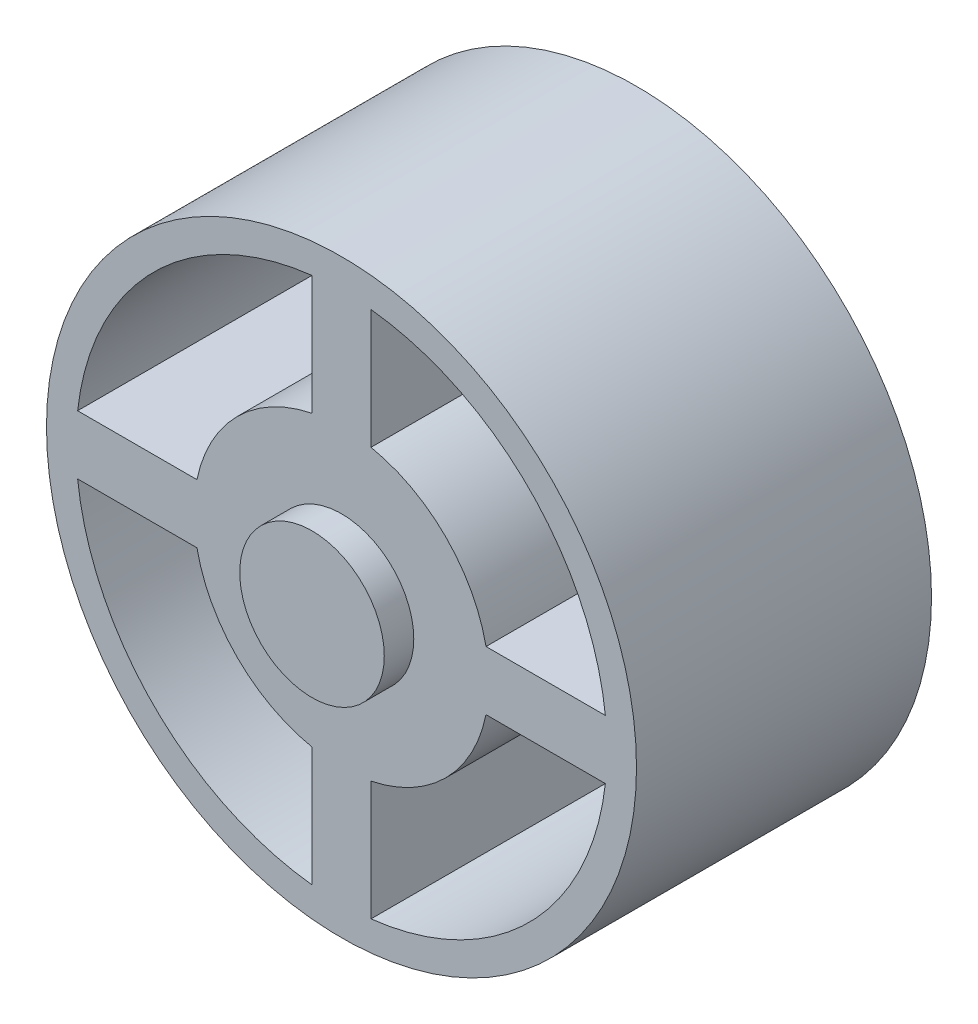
from build123d import *

# Parameters (mm, degrees)
SKETCH1_R                = 100
BOSS_EXTRUDE1_DEPTH      = 100
BOSS_EXTRUDE2_DEPTH      = 10
BOSS_EXTRUDE2_DEPTH_BACK = 110
SKETCH2_R                = 24.5


with BuildPart() as part:
    # Sketch1 → Boss-Extrude1 (new body)
    with BuildSketch(Plane.XY):
        Circle(SKETCH1_R)
        with BuildLine():
            Line((-10, 89.4427191), (-10, 48.989794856))
            ThreePointArc((-10, 48.989794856), (-35.355339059, 35.355339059), (-48.989794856, 10))
            Line((-48.989794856, 10), (-89.4427191, 10))
            ThreePointArc((-89.4427191, 10), (-63.639610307, 63.639610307), (-10, 89.4427191))
        make_face(mode=Mode.SUBTRACT)
        with BuildLine():
            Line((10, 89.4427191), (10, 48.989794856))
            ThreePointArc((10, 48.989794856), (35.355339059, 35.355339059), (48.989794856, 10))
            Line((48.989794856, 10), (89.4427191, 10))
            ThreePointArc((89.4427191, 10), (63.639610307, 63.639610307), (10, 89.4427191))
        make_face(mode=Mode.SUBTRACT)
        with BuildLine():
            Line((89.4427191, -10), (48.989794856, -10))
            ThreePointArc((48.989794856, -10), (35.355339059, -35.355339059), (10, -48.989794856))
            Line((10, -48.989794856), (10, -89.4427191))
            ThreePointArc((10, -89.4427191), (63.639610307, -63.639610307), (89.4427191, -10))
        make_face(mode=Mode.SUBTRACT)
        with BuildLine():
            Line((-10, -89.4427191), (-10, -48.989794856))
            ThreePointArc((-10, -48.989794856), (-35.355339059, -35.355339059), (-48.989794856, -10))
            Line((-48.989794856, -10), (-89.4427191, -10))
            ThreePointArc((-89.4427191, -10), (-63.639610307, -63.639610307), (-10, -89.4427191))
        make_face(mode=Mode.SUBTRACT)
    extrude(amount=BOSS_EXTRUDE1_DEPTH)

    # Sketch2 → Boss-Extrude2 (add, two sides: drawn at the far end of the back side and taken through both)
    with BuildSketch(Plane.XY.offset(100).offset(-BOSS_EXTRUDE2_DEPTH_BACK)):
        Circle(SKETCH2_R)
    extrude(amount=BOSS_EXTRUDE2_DEPTH + BOSS_EXTRUDE2_DEPTH_BACK)


solid = part.part
